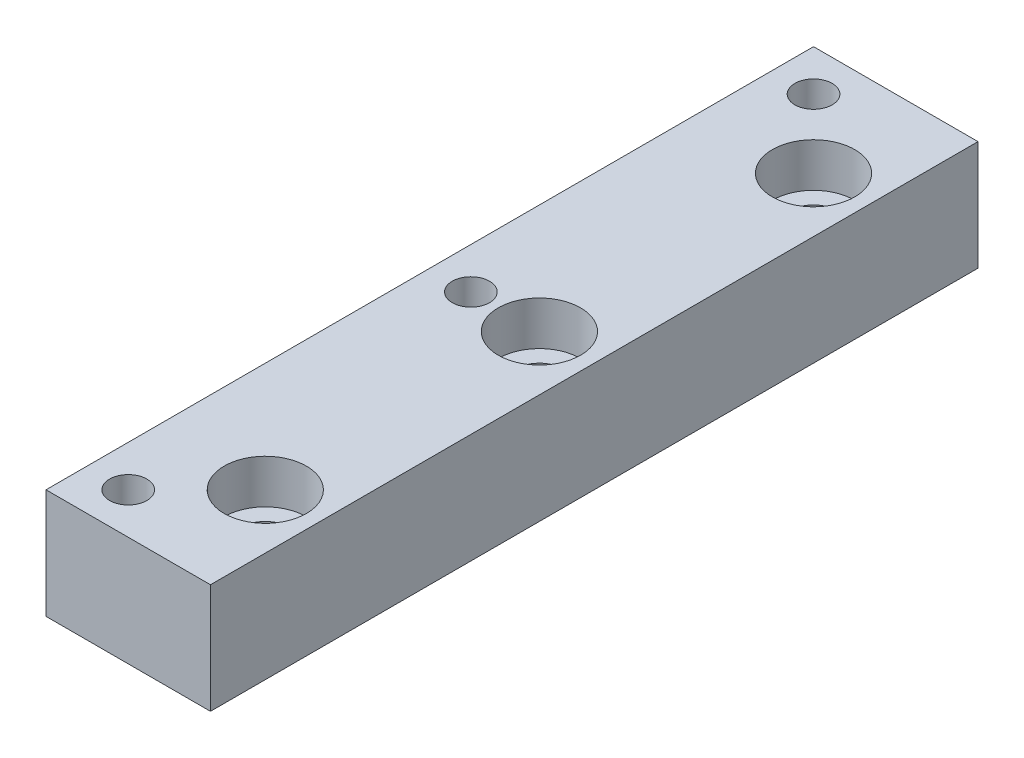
from build123d import *

# Parameters (mm, degrees)
ESQUISSE1_W                             = 30
ESQUISSE1_H                             = 20
EXTRUSION1_DEPTH                        = 70
TROU_TARAUD_M81_D                       = 6.8
CHAMBRAGE_POUR_AXES_8_5_MM1_D           = 8.5
CHAMBRAGE_POUR_AXES_8_5_MM1_CBORE_D     = 15
CHAMBRAGE_POUR_AXES_8_5_MM1_CBORE_DEPTH = 8


with BuildPart() as part:
    # Esquisse1 → Extrusion1 (new, symmetric)
    with BuildSketch(Plane.XY):
        with Locations((15, 10)):
            Rectangle(ESQUISSE1_W, ESQUISSE1_H)
    extrude(amount=EXTRUSION1_DEPTH, both=True)

    # Trou taraud_ M81 (through all)
    with Locations(Plane(origin=(0, 20, 0), x_dir=(-1, 0, 0), z_dir=(0, 1, 0))):
        with Locations((-7.5, 62.5), (-7.5, 0), (-7.5, -62.5)):
            Hole(TROU_TARAUD_M81_D / 2)

    # Chambrage pour axes 8.5 mm1 (through all)
    with Locations(Plane(origin=(0, 20, 0), x_dir=(-1, 0, 0), z_dir=(0, 1, 0))):
        with Locations((-20, 50), (-20, 0), (-20, -50)):
            CounterBoreHole(CHAMBRAGE_POUR_AXES_8_5_MM1_D / 2, CHAMBRAGE_POUR_AXES_8_5_MM1_CBORE_D / 2, CHAMBRAGE_POUR_AXES_8_5_MM1_CBORE_DEPTH)


solid = part.part
